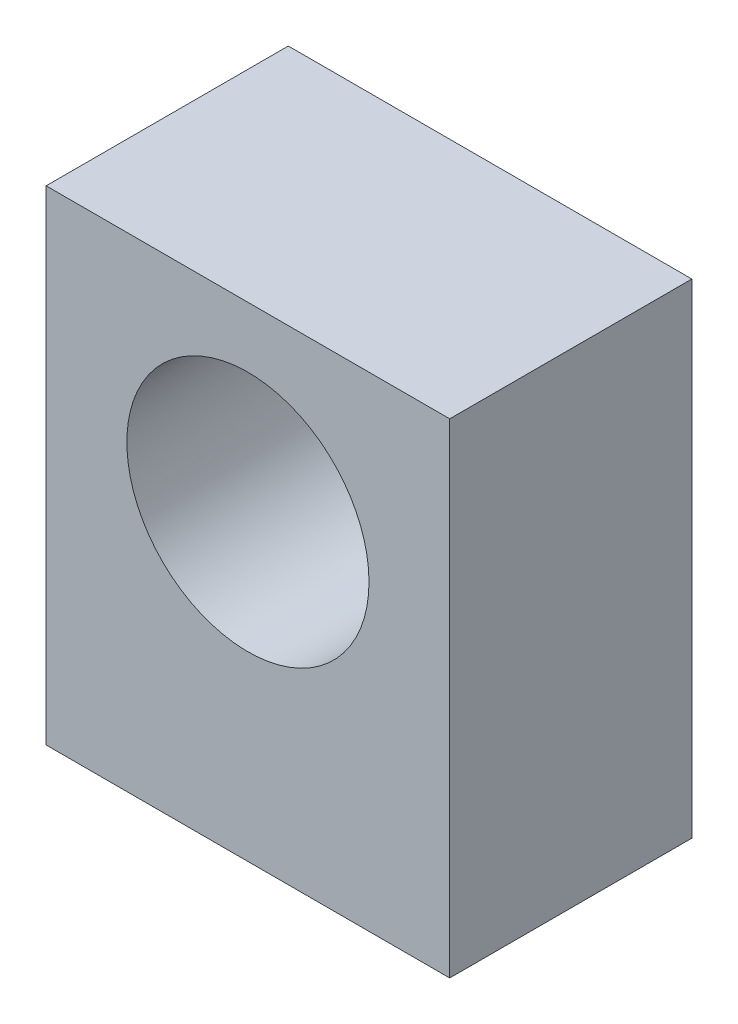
ISO-10303-21;
HEADER;
FILE_DESCRIPTION(('STEP AP214'),'2;1');
FILE_NAME('part.step','',(''),(''),'','','');
FILE_SCHEMA(('AUTOMOTIVE_DESIGN { 1 0 10303 214 1 1 1 1 }'));
ENDSEC;
DATA;
#1=APPLICATION_CONTEXT('core data for automotive mechanical design processes');
#2=APPLICATION_PROTOCOL_DEFINITION('international standard','automotive_design',2000,#1);
#3=PRODUCT_CONTEXT('',#1,'mechanical');
#4=PRODUCT('Part','Part','',(#3));
#5=PRODUCT_RELATED_PRODUCT_CATEGORY('part','',(#4));
#6=PRODUCT_DEFINITION_FORMATION('','',#4);
#7=PRODUCT_DEFINITION_CONTEXT('part definition',#1,'design');
#8=PRODUCT_DEFINITION('design','',#6,#7);
#9=PRODUCT_DEFINITION_SHAPE('','',#8);
#10=(LENGTH_UNIT() NAMED_UNIT(*) SI_UNIT(.MILLI.,.METRE.));
#11=(NAMED_UNIT(*) PLANE_ANGLE_UNIT() SI_UNIT($,.RADIAN.));
#12=(NAMED_UNIT(*) SI_UNIT($,.STERADIAN.) SOLID_ANGLE_UNIT());
#13=UNCERTAINTY_MEASURE_WITH_UNIT(LENGTH_MEASURE(1.E-05),#10,'distance_accuracy_value','');
#14=(GEOMETRIC_REPRESENTATION_CONTEXT(3) GLOBAL_UNCERTAINTY_ASSIGNED_CONTEXT((#13)) GLOBAL_UNIT_ASSIGNED_CONTEXT((#10,
#11,#12)) REPRESENTATION_CONTEXT('',''));
#15=CARTESIAN_POINT('',(0.,0.,0.));
#16=DIRECTION('',(0.,0.,1.));
#17=DIRECTION('',(1.,0.,0.));
#18=AXIS2_PLACEMENT_3D('',#15,#16,#17);
#19=CARTESIAN_POINT('',(15.875,0.,19.05));
#20=DIRECTION('',(-1.,0.,0.));
#21=DIRECTION('',(0.,-1.,0.));
#22=AXIS2_PLACEMENT_3D('',#19,#20,#21);
#23=PLANE('',#22);
#24=DIRECTION('',(0.,1.,0.));
#25=VECTOR('',#24,1.);
#26=CARTESIAN_POINT('',(15.875,0.,0.));
#27=LINE('',#26,#25);
#28=CARTESIAN_POINT('',(15.875,0.,0.));
#29=VERTEX_POINT('',#28);
#30=CARTESIAN_POINT('',(15.875,38.1,0.));
#31=VERTEX_POINT('',#30);
#32=EDGE_CURVE('E80',#29,#31,#27,.T.);
#33=ORIENTED_EDGE('',*,*,#32,.T.);
#34=DIRECTION('',(0.,0.,-1.));
#35=VECTOR('',#34,1.);
#36=CARTESIAN_POINT('',(15.875,38.1,19.05));
#37=LINE('',#36,#35);
#38=CARTESIAN_POINT('',(15.875,38.1,19.05));
#39=VERTEX_POINT('',#38);
#40=EDGE_CURVE('E11',#39,#31,#37,.T.);
#41=ORIENTED_EDGE('',*,*,#40,.F.);
#42=DIRECTION('',(0.,1.,0.));
#43=VECTOR('',#42,1.);
#44=CARTESIAN_POINT('',(15.875,0.,19.05));
#45=LINE('',#44,#43);
#46=CARTESIAN_POINT('',(15.875,0.,19.05));
#47=VERTEX_POINT('',#46);
#48=EDGE_CURVE('E95',#47,#39,#45,.T.);
#49=ORIENTED_EDGE('',*,*,#48,.F.);
#50=DIRECTION('',(0.,0.,-1.));
#51=VECTOR('',#50,1.);
#52=CARTESIAN_POINT('',(15.875,0.,19.05));
#53=LINE('',#52,#51);
#54=EDGE_CURVE('E44',#47,#29,#53,.T.);
#55=ORIENTED_EDGE('',*,*,#54,.T.);
#56=EDGE_LOOP('',(#33,#41,#49,#55));
#57=FACE_BOUND('',#56,.T.);
#58=ADVANCED_FACE('F30',(#57),#23,.F.);
#59=CARTESIAN_POINT('',(-15.875,38.1,19.05));
#60=DIRECTION('',(0.,1.,0.));
#61=DIRECTION('',(0.,0.,1.));
#62=AXIS2_PLACEMENT_3D('',#59,#60,#61);
#63=PLANE('',#62);
#64=DIRECTION('',(1.,0.,0.));
#65=VECTOR('',#64,1.);
#66=CARTESIAN_POINT('',(-15.875,38.1,0.));
#67=LINE('',#66,#65);
#68=CARTESIAN_POINT('',(-15.875,38.1,0.));
#69=VERTEX_POINT('',#68);
#70=EDGE_CURVE('E76',#69,#31,#67,.T.);
#71=ORIENTED_EDGE('',*,*,#70,.F.);
#72=DIRECTION('',(0.,0.,-1.));
#73=VECTOR('',#72,1.);
#74=CARTESIAN_POINT('',(-15.875,38.1,19.05));
#75=LINE('',#74,#73);
#76=CARTESIAN_POINT('',(-15.875,38.1,19.05));
#77=VERTEX_POINT('',#76);
#78=EDGE_CURVE('E37',#77,#69,#75,.T.);
#79=ORIENTED_EDGE('',*,*,#78,.F.);
#80=DIRECTION('',(1.,0.,0.));
#81=VECTOR('',#80,1.);
#82=CARTESIAN_POINT('',(-15.875,38.1,19.05));
#83=LINE('',#82,#81);
#84=EDGE_CURVE('E77',#77,#39,#83,.T.);
#85=ORIENTED_EDGE('',*,*,#84,.T.);
#86=ORIENTED_EDGE('',*,*,#40,.T.);
#87=EDGE_LOOP('',(#71,#79,#85,#86));
#88=FACE_BOUND('',#87,.T.);
#89=ADVANCED_FACE('F74',(#88),#63,.T.);
#90=CARTESIAN_POINT('',(-15.875,38.1,19.05));
#91=DIRECTION('',(1.,0.,0.));
#92=DIRECTION('',(0.,1.,0.));
#93=AXIS2_PLACEMENT_3D('',#90,#91,#92);
#94=PLANE('',#93);
#95=DIRECTION('',(0.,-1.,0.));
#96=VECTOR('',#95,1.);
#97=CARTESIAN_POINT('',(-15.875,38.1,0.));
#98=LINE('',#97,#96);
#99=CARTESIAN_POINT('',(-15.875,0.,0.));
#100=VERTEX_POINT('',#99);
#101=EDGE_CURVE('E88',#69,#100,#98,.T.);
#102=ORIENTED_EDGE('',*,*,#101,.T.);
#103=DIRECTION('',(0.,0.,-1.));
#104=VECTOR('',#103,1.);
#105=CARTESIAN_POINT('',(-15.875,0.,19.05));
#106=LINE('',#105,#104);
#107=CARTESIAN_POINT('',(-15.875,0.,19.05));
#108=VERTEX_POINT('',#107);
#109=EDGE_CURVE('E102',#108,#100,#106,.T.);
#110=ORIENTED_EDGE('',*,*,#109,.F.);
#111=DIRECTION('',(0.,-1.,0.));
#112=VECTOR('',#111,1.);
#113=CARTESIAN_POINT('',(-15.875,38.1,19.05));
#114=LINE('',#113,#112);
#115=EDGE_CURVE('E52',#77,#108,#114,.T.);
#116=ORIENTED_EDGE('',*,*,#115,.F.);
#117=ORIENTED_EDGE('',*,*,#78,.T.);
#118=EDGE_LOOP('',(#102,#110,#116,#117));
#119=FACE_BOUND('',#118,.T.);
#120=ADVANCED_FACE('F104',(#119),#94,.F.);
#121=CARTESIAN_POINT('',(15.875,0.,19.05));
#122=DIRECTION('',(0.,-1.,0.));
#123=DIRECTION('',(1.,0.,0.));
#124=AXIS2_PLACEMENT_3D('',#121,#122,#123);
#125=PLANE('',#124);
#126=DIRECTION('',(-1.,0.,0.));
#127=VECTOR('',#126,1.);
#128=CARTESIAN_POINT('',(15.875,0.,0.));
#129=LINE('',#128,#127);
#130=EDGE_CURVE('E90',#29,#100,#129,.T.);
#131=ORIENTED_EDGE('',*,*,#130,.F.);
#132=ORIENTED_EDGE('',*,*,#54,.F.);
#133=DIRECTION('',(-1.,0.,0.));
#134=VECTOR('',#133,1.);
#135=CARTESIAN_POINT('',(15.875,0.,19.05));
#136=LINE('',#135,#134);
#137=EDGE_CURVE('E99',#47,#108,#136,.T.);
#138=ORIENTED_EDGE('',*,*,#137,.T.);
#139=ORIENTED_EDGE('',*,*,#109,.T.);
#140=EDGE_LOOP('',(#131,#132,#138,#139));
#141=FACE_BOUND('',#140,.T.);
#142=ADVANCED_FACE('F106',(#141),#125,.T.);
#143=CARTESIAN_POINT('',(15.875,38.1,19.05));
#144=DIRECTION('',(0.,0.,-1.));
#145=DIRECTION('',(-1.,0.,0.));
#146=AXIS2_PLACEMENT_3D('',#143,#144,#145);
#147=PLANE('',#146);
#148=CARTESIAN_POINT('',(0.,23.8125,19.05));
#149=DIRECTION('',(0.,0.,1.));
#150=DIRECTION('',(1.,0.,0.));
#151=AXIS2_PLACEMENT_3D('',#148,#149,#150);
#152=CIRCLE('',#151,9.525);
#153=CARTESIAN_POINT('',(9.525,23.8125,19.05));
#154=VERTEX_POINT('',#153);
#155=EDGE_CURVE('E154',#154,#154,#152,.T.);
#156=ORIENTED_EDGE('',*,*,#155,.F.);
#157=EDGE_LOOP('',(#156));
#158=FACE_BOUND('',#157,.T.);
#159=ORIENTED_EDGE('',*,*,#48,.T.);
#160=ORIENTED_EDGE('',*,*,#84,.F.);
#161=ORIENTED_EDGE('',*,*,#115,.T.);
#162=ORIENTED_EDGE('',*,*,#137,.F.);
#163=EDGE_LOOP('',(#159,#160,#161,#162));
#164=FACE_BOUND('',#163,.T.);
#165=ADVANCED_FACE('F105',(#158,#164),#147,.F.);
#166=CARTESIAN_POINT('',(15.875,38.1,0.));
#167=DIRECTION('',(0.,0.,-1.));
#168=DIRECTION('',(-1.,0.,0.));
#169=AXIS2_PLACEMENT_3D('',#166,#167,#168);
#170=PLANE('',#169);
#171=CARTESIAN_POINT('',(0.,23.8125,0.));
#172=DIRECTION('',(0.,0.,1.));
#173=DIRECTION('',(1.,0.,0.));
#174=AXIS2_PLACEMENT_3D('',#171,#172,#173);
#175=CIRCLE('',#174,9.525);
#176=CARTESIAN_POINT('',(9.525,23.8125,0.));
#177=VERTEX_POINT('',#176);
#178=EDGE_CURVE('E83',#177,#177,#175,.T.);
#179=ORIENTED_EDGE('',*,*,#178,.T.);
#180=EDGE_LOOP('',(#179));
#181=FACE_BOUND('',#180,.T.);
#182=ORIENTED_EDGE('',*,*,#32,.F.);
#183=ORIENTED_EDGE('',*,*,#130,.T.);
#184=ORIENTED_EDGE('',*,*,#101,.F.);
#185=ORIENTED_EDGE('',*,*,#70,.T.);
#186=EDGE_LOOP('',(#182,#183,#184,#185));
#187=FACE_BOUND('',#186,.T.);
#188=ADVANCED_FACE('F86',(#181,#187),#170,.T.);
#189=CARTESIAN_POINT('',(0.,23.8125,0.));
#190=DIRECTION('',(0.,0.,1.));
#191=DIRECTION('',(1.,0.,0.));
#192=AXIS2_PLACEMENT_3D('',#189,#190,#191);
#193=CYLINDRICAL_SURFACE('',#192,9.525);
#194=CARTESIAN_POINT('',(9.525,23.8125,0.));
#195=CARTESIAN_POINT('',(9.525,23.8125,0.1984375));
#196=CARTESIAN_POINT('',(9.525,23.8125,0.396875));
#197=CARTESIAN_POINT('',(9.525,23.8125,0.79375));
#198=CARTESIAN_POINT('',(9.525,23.8125,0.9921875));
#199=CARTESIAN_POINT('',(9.525,23.8125,1.3890625));
#200=CARTESIAN_POINT('',(9.525,23.8125,1.5875));
#201=CARTESIAN_POINT('',(9.525,23.8125,1.984375));
#202=CARTESIAN_POINT('',(9.525,23.8125,2.1828125));
#203=CARTESIAN_POINT('',(9.525,23.8125,2.5796875));
#204=CARTESIAN_POINT('',(9.525,23.8125,2.778125));
#205=CARTESIAN_POINT('',(9.525,23.8125,3.175));
#206=CARTESIAN_POINT('',(9.525,23.8125,3.3734375));
#207=CARTESIAN_POINT('',(9.525,23.8125,3.7703125));
#208=CARTESIAN_POINT('',(9.525,23.8125,3.96875));
#209=CARTESIAN_POINT('',(9.525,23.8125,4.365625));
#210=CARTESIAN_POINT('',(9.525,23.8125,4.5640625));
#211=CARTESIAN_POINT('',(9.525,23.8125,4.9609375));
#212=CARTESIAN_POINT('',(9.525,23.8125,5.159375));
#213=CARTESIAN_POINT('',(9.525,23.8125,5.55625));
#214=CARTESIAN_POINT('',(9.525,23.8125,5.7546875));
#215=CARTESIAN_POINT('',(9.525,23.8125,6.1515625));
#216=CARTESIAN_POINT('',(9.525,23.8125,6.35));
#217=CARTESIAN_POINT('',(9.525,23.8125,6.746875));
#218=CARTESIAN_POINT('',(9.525,23.8125,6.9453125));
#219=CARTESIAN_POINT('',(9.525,23.8125,7.3421875));
#220=CARTESIAN_POINT('',(9.525,23.8125,7.540625));
#221=CARTESIAN_POINT('',(9.525,23.8125,7.9375));
#222=CARTESIAN_POINT('',(9.525,23.8125,8.1359375));
#223=CARTESIAN_POINT('',(9.525,23.8125,8.5328125));
#224=CARTESIAN_POINT('',(9.525,23.8125,8.73125));
#225=CARTESIAN_POINT('',(9.525,23.8125,9.128125));
#226=CARTESIAN_POINT('',(9.525,23.8125,9.3265625));
#227=CARTESIAN_POINT('',(9.525,23.8125,9.7234375));
#228=CARTESIAN_POINT('',(9.525,23.8125,9.921875));
#229=CARTESIAN_POINT('',(9.525,23.8125,10.31875));
#230=CARTESIAN_POINT('',(9.525,23.8125,10.5171875));
#231=CARTESIAN_POINT('',(9.525,23.8125,10.9140625));
#232=CARTESIAN_POINT('',(9.525,23.8125,11.1125));
#233=CARTESIAN_POINT('',(9.525,23.8125,11.509375));
#234=CARTESIAN_POINT('',(9.525,23.8125,11.7078125));
#235=CARTESIAN_POINT('',(9.525,23.8125,12.1046875));
#236=CARTESIAN_POINT('',(9.525,23.8125,12.303125));
#237=CARTESIAN_POINT('',(9.525,23.8125,12.7));
#238=CARTESIAN_POINT('',(9.525,23.8125,12.8984375));
#239=CARTESIAN_POINT('',(9.525,23.8125,13.2953125));
#240=CARTESIAN_POINT('',(9.525,23.8125,13.49375));
#241=CARTESIAN_POINT('',(9.525,23.8125,13.890625));
#242=CARTESIAN_POINT('',(9.525,23.8125,14.0890625));
#243=CARTESIAN_POINT('',(9.525,23.8125,14.4859375));
#244=CARTESIAN_POINT('',(9.525,23.8125,14.684375));
#245=CARTESIAN_POINT('',(9.525,23.8125,15.08125));
#246=CARTESIAN_POINT('',(9.525,23.8125,15.2796875));
#247=CARTESIAN_POINT('',(9.525,23.8125,15.6765625));
#248=CARTESIAN_POINT('',(9.525,23.8125,15.875));
#249=CARTESIAN_POINT('',(9.525,23.8125,16.271875));
#250=CARTESIAN_POINT('',(9.525,23.8125,16.4703125));
#251=CARTESIAN_POINT('',(9.525,23.8125,16.8671875));
#252=CARTESIAN_POINT('',(9.525,23.8125,17.065625));
#253=CARTESIAN_POINT('',(9.525,23.8125,17.4625));
#254=CARTESIAN_POINT('',(9.525,23.8125,17.6609375));
#255=CARTESIAN_POINT('',(9.525,23.8125,18.0578125));
#256=CARTESIAN_POINT('',(9.525,23.8125,18.25625));
#257=CARTESIAN_POINT('',(9.525,23.8125,18.653125));
#258=CARTESIAN_POINT('',(9.525,23.8125,18.8515625));
#259=CARTESIAN_POINT('',(9.525,23.8125,19.05));
#260=B_SPLINE_CURVE_WITH_KNOTS('',3,(#194,#195,#196,#197,#198,#199,#200,#201,#202,#203,#204,
#205,#206,#207,#208,#209,#210,#211,#212,#213,#214,#215,#216,#217,#218,#219,#220,#221,#222,#223,
#224,#225,#226,#227,#228,#229,#230,#231,#232,#233,#234,#235,#236,#237,#238,#239,#240,#241,#242,
#243,#244,#245,#246,#247,#248,#249,#250,#251,#252,#253,#254,#255,#256,#257,#258,#259),
.UNSPECIFIED.,.F.,.F.,(4,2,2,2,2,2,2,2,2,2,2,2,2,2,2,2,2,2,2,2,2,2,2,2,2,2,2,2,2,2,2,2,4),(0.,
0.5953125,1.190625,1.7859375,2.38125,2.9765625,3.571875,4.1671875,4.7625,5.3578125,5.953125,
6.5484375,7.14375,7.7390625,8.334375,8.9296875,9.525,10.1203125,10.715625,11.3109375,11.90625,
12.5015625,13.096875,13.6921875,14.2875,14.8828125,15.478125,16.0734375,16.66875,17.2640625,
17.859375,18.4546875,19.05),.UNSPECIFIED.);
#261=EDGE_CURVE('BSEAM139',#177,#154,#260,.T.);
#262=ORIENTED_EDGE('',*,*,#178,.F.);
#263=ORIENTED_EDGE('',*,*,#155,.T.);
#264=ORIENTED_EDGE('',*,*,#261,.T.);
#265=ORIENTED_EDGE('',*,*,#261,.F.);
#266=EDGE_LOOP('',(#262,#264,#263,#265));
#267=FACE_BOUND('',#266,.T.);
#268=ADVANCED_FACE('F139',(#267),#193,.F.);
#269=CLOSED_SHELL('',(#58,#89,#120,#142,#165,#188,#268));
#270=MANIFOLD_SOLID_BREP('B2',#269);
#271=ADVANCED_BREP_SHAPE_REPRESENTATION('',(#18,#270),#14);
#272=SHAPE_DEFINITION_REPRESENTATION(#9,#271);
ENDSEC;
END-ISO-10303-21;
